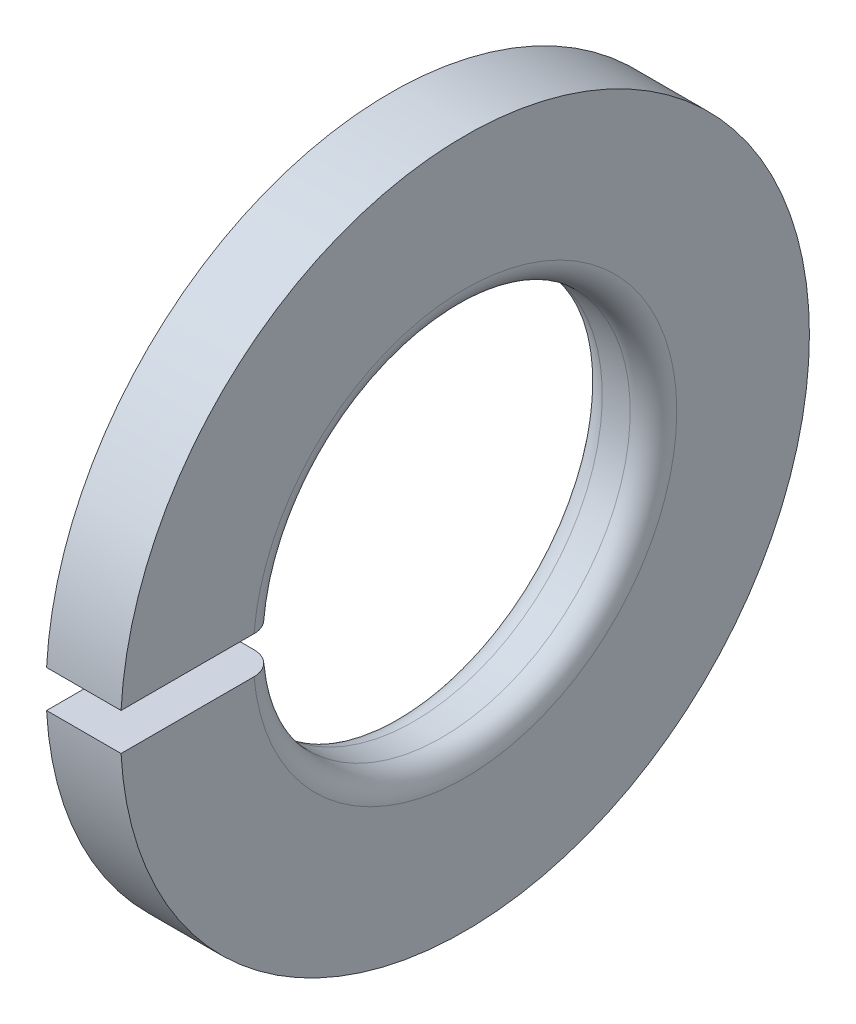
from build123d import *

# Parameters (mm, degrees)
SKETCH2_W = 0.8
SKETCH2_H = 7.548
GAP_DEPTH = 11.586784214


with BuildPart() as part:
    # Sketch1 → Base-Revolve (revolve)
    with BuildSketch(Plane.XY, mode=Mode.PRIVATE) as base_revolve_sk:
        with BuildLine():
            Line((0, 4.55), (0, 7.4))
            Line((0, 7.4), (-1.6, 7.4))
            Line((-1.6, 7.4), (-1.6, 4.55))
            ThreePointArc((-1.6, 4.55), (-1.453553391, 4.196446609), (-1.1, 4.05))
            Line((-1.1, 4.05), (-0.5, 4.05))
            ThreePointArc((-0.5, 4.05), (-0.146446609, 4.196446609), (0, 4.55))
        make_face()
    revolve(base_revolve_sk.sketch.rotate(Axis((-34.925, 0, 0), (1, 0, 0)), 90), axis=Axis((-34.925, 0, 0), (1, 0, 0)))

    # Sketch2 → Gap (cut, through all)
    with BuildSketch(Plane(origin=(0, 0, 0), x_dir=(0, -1, 0), z_dir=(-1, 0, 0))):
        with Locations((0, 3.774)):
            Rectangle(SKETCH2_W, SKETCH2_H)
    extrude(amount=GAP_DEPTH, mode=Mode.SUBTRACT)


solid = part.part
